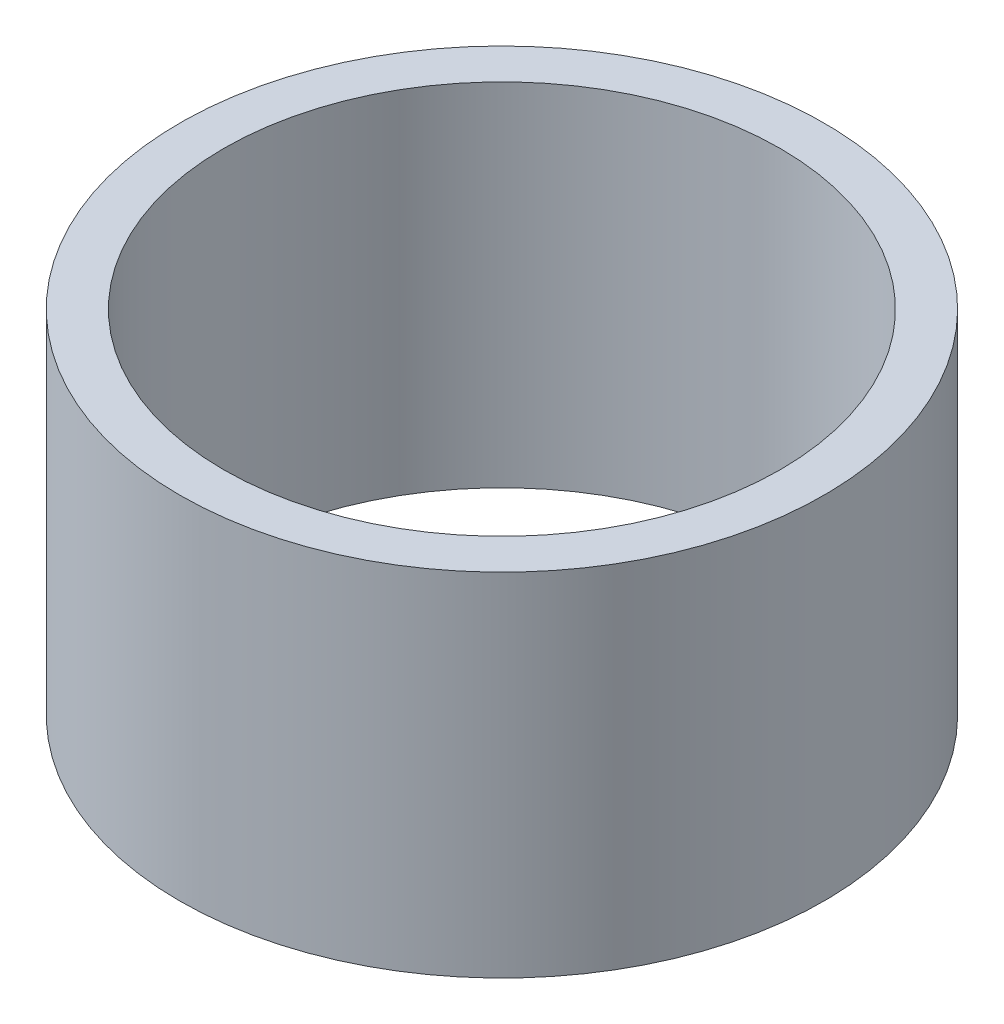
ISO-10303-21;
HEADER;
FILE_DESCRIPTION(('STEP AP214'),'2;1');
FILE_NAME('part.step','',(''),(''),'','','');
FILE_SCHEMA(('AUTOMOTIVE_DESIGN { 1 0 10303 214 1 1 1 1 }'));
ENDSEC;
DATA;
#1=APPLICATION_CONTEXT('core data for automotive mechanical design processes');
#2=APPLICATION_PROTOCOL_DEFINITION('international standard','automotive_design',2000,#1);
#3=PRODUCT_CONTEXT('',#1,'mechanical');
#4=PRODUCT('Part','Part','',(#3));
#5=PRODUCT_RELATED_PRODUCT_CATEGORY('part','',(#4));
#6=PRODUCT_DEFINITION_FORMATION('','',#4);
#7=PRODUCT_DEFINITION_CONTEXT('part definition',#1,'design');
#8=PRODUCT_DEFINITION('design','',#6,#7);
#9=PRODUCT_DEFINITION_SHAPE('','',#8);
#10=(LENGTH_UNIT() NAMED_UNIT(*) SI_UNIT(.MILLI.,.METRE.));
#11=(NAMED_UNIT(*) PLANE_ANGLE_UNIT() SI_UNIT($,.RADIAN.));
#12=(NAMED_UNIT(*) SI_UNIT($,.STERADIAN.) SOLID_ANGLE_UNIT());
#13=UNCERTAINTY_MEASURE_WITH_UNIT(LENGTH_MEASURE(1.E-05),#10,'distance_accuracy_value','');
#14=(GEOMETRIC_REPRESENTATION_CONTEXT(3) GLOBAL_UNCERTAINTY_ASSIGNED_CONTEXT((#13)) GLOBAL_UNIT_ASSIGNED_CONTEXT((#10,
#11,#12)) REPRESENTATION_CONTEXT('',''));
#15=CARTESIAN_POINT('',(0.,0.,0.));
#16=DIRECTION('',(0.,0.,1.));
#17=DIRECTION('',(1.,0.,0.));
#18=AXIS2_PLACEMENT_3D('',#15,#16,#17);
#19=CARTESIAN_POINT('',(0.,12.,0.));
#20=DIRECTION('',(0.,1.,0.));
#21=DIRECTION('',(0.,0.,1.));
#22=AXIS2_PLACEMENT_3D('',#19,#20,#21);
#23=PLANE('',#22);
#24=CARTESIAN_POINT('',(0.,12.,0.));
#25=DIRECTION('',(0.,1.,0.));
#26=DIRECTION('',(0.,0.,1.));
#27=AXIS2_PLACEMENT_3D('',#24,#25,#26);
#28=CIRCLE('',#27,11.);
#29=CARTESIAN_POINT('',(0.,12.,11.));
#30=VERTEX_POINT('',#29);
#31=EDGE_CURVE('E10',#30,#30,#28,.T.);
#32=ORIENTED_EDGE('',*,*,#31,.T.);
#33=EDGE_LOOP('',(#32));
#34=FACE_BOUND('',#33,.T.);
#35=CARTESIAN_POINT('',(0.,12.,0.));
#36=DIRECTION('',(0.,1.,0.));
#37=DIRECTION('',(0.,0.,1.));
#38=AXIS2_PLACEMENT_3D('',#35,#36,#37);
#39=CIRCLE('',#38,9.5);
#40=CARTESIAN_POINT('',(0.,12.,9.5));
#41=VERTEX_POINT('',#40);
#42=EDGE_CURVE('E39',#41,#41,#39,.T.);
#43=ORIENTED_EDGE('',*,*,#42,.F.);
#44=EDGE_LOOP('',(#43));
#45=FACE_BOUND('',#44,.T.);
#46=ADVANCED_FACE('F28',(#34,#45),#23,.T.);
#47=CARTESIAN_POINT('',(0.,0.,0.));
#48=DIRECTION('',(0.,1.,0.));
#49=DIRECTION('',(0.,0.,1.));
#50=AXIS2_PLACEMENT_3D('',#47,#48,#49);
#51=PLANE('',#50);
#52=CARTESIAN_POINT('',(0.,0.,0.));
#53=DIRECTION('',(0.,1.,0.));
#54=DIRECTION('',(0.,0.,1.));
#55=AXIS2_PLACEMENT_3D('',#52,#53,#54);
#56=CIRCLE('',#55,11.);
#57=CARTESIAN_POINT('',(0.,0.,11.));
#58=VERTEX_POINT('',#57);
#59=EDGE_CURVE('E35',#58,#58,#56,.T.);
#60=ORIENTED_EDGE('',*,*,#59,.F.);
#61=EDGE_LOOP('',(#60));
#62=FACE_BOUND('',#61,.T.);
#63=CARTESIAN_POINT('',(0.,0.,0.));
#64=DIRECTION('',(0.,1.,0.));
#65=DIRECTION('',(0.,0.,1.));
#66=AXIS2_PLACEMENT_3D('',#63,#64,#65);
#67=CIRCLE('',#66,9.5);
#68=CARTESIAN_POINT('',(0.,0.,9.5));
#69=VERTEX_POINT('',#68);
#70=EDGE_CURVE('E43',#69,#69,#67,.T.);
#71=ORIENTED_EDGE('',*,*,#70,.T.);
#72=EDGE_LOOP('',(#71));
#73=FACE_BOUND('',#72,.T.);
#74=ADVANCED_FACE('F49',(#62,#73),#51,.F.);
#75=CARTESIAN_POINT('',(0.,12.,0.));
#76=DIRECTION('',(0.,-1.,0.));
#77=DIRECTION('',(0.,0.,-1.));
#78=AXIS2_PLACEMENT_3D('',#75,#76,#77);
#79=CYLINDRICAL_SURFACE('',#78,11.);
#80=ORIENTED_EDGE('',*,*,#31,.F.);
#81=EDGE_LOOP('',(#80));
#82=FACE_BOUND('',#81,.T.);
#83=ORIENTED_EDGE('',*,*,#59,.T.);
#84=EDGE_LOOP('',(#83));
#85=FACE_BOUND('',#84,.T.);
#86=ADVANCED_FACE('F30',(#82,#85),#79,.T.);
#87=CARTESIAN_POINT('',(0.,12.,0.));
#88=DIRECTION('',(0.,-1.,0.));
#89=DIRECTION('',(0.,0.,-1.));
#90=AXIS2_PLACEMENT_3D('',#87,#88,#89);
#91=CYLINDRICAL_SURFACE('',#90,9.5);
#92=ORIENTED_EDGE('',*,*,#42,.T.);
#93=EDGE_LOOP('',(#92));
#94=FACE_BOUND('',#93,.T.);
#95=ORIENTED_EDGE('',*,*,#70,.F.);
#96=EDGE_LOOP('',(#95));
#97=FACE_BOUND('',#96,.T.);
#98=ADVANCED_FACE('F51',(#94,#97),#91,.F.);
#99=CLOSED_SHELL('',(#46,#74,#86,#98));
#100=MANIFOLD_SOLID_BREP('B2',#99);
#101=ADVANCED_BREP_SHAPE_REPRESENTATION('',(#18,#100),#14);
#102=SHAPE_DEFINITION_REPRESENTATION(#9,#101);
ENDSEC;
END-ISO-10303-21;
